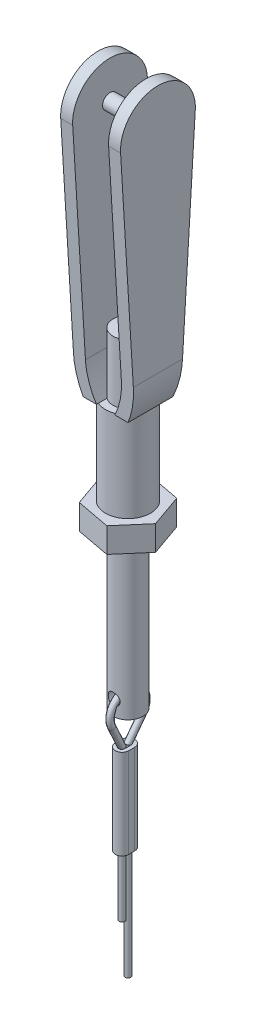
from build123d import *

# Parameters (mm, degrees)
EXTRUSION1_DEPTH             = 3
ENL_V_MAT_EXTRU_1_DEPTH      = 21.976176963
ENL_V_MAT_EXTRU_2_DEPTH      = 21.615528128
ESQUISSE4_R                  = 0.5
EXTRUSION2_DEPTH             = 2.4
ESQUISSE5_R                  = 1.5
EXTRUSION3_DEPTH             = 6
ESQUISSE6_R                  = 1
ENL_V_MAT_EXTRU_3_DEPTH      = 10
BOSS_EXTRU_1_DEPTH           = 12
BOSS_EXTRU_1_DEPTH_BACK      = 10
ESQUISSE8_R                  = 1
ENL_V_MAT_EXTRU_4_DEPTH      = 20.267848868
ENL_V_MAT_EXTRU_4_DEPTH_BACK = 20.267848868
ESQUISSE9_R                  = 0.4
ESQUISSE11_R                 = 0.2
BOSS_EXTRU_2_DEPTH           = 6
ESQUISSE14_R                 = 1
BOSS_EXTRU_4_DEPTH           = 1.66


with BuildPart() as part:
    # Esquisse1 → Extrusion1 (new, symmetric)
    with BuildSketch(Plane.XY):
        with BuildLine():
            Line((-2, 2.355843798), (-2, 20))
            Line((-2, 20), (2, 20))
            Line((2, 20), (2, 2.355843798))
            ThreePointArc((2, 2.355843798), (1.873623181, 1.15168434), (1.5, 0))
            Line((1.5, 0), (-1.5, 0))
            ThreePointArc((-1.5, 0), (-1.873623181, 1.15168434), (-2, 2.355843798))
        make_face()
    extrude(amount=EXTRUSION1_DEPTH, both=True)

    # Esquisse2 → Enl_v. mat.-Extru.1 (cut, through all)
    with BuildSketch(Plane.XY.offset(3)):
        with BuildLine():
            Line((-1.2, 20), (-1.2, 2.355843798))
            ThreePointArc((-1.2, 2.355843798), (-1.050313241, 1.14156975), (-0.610215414, 0))
            Line((-0.610215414, 0), (0.610215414, 0))
            ThreePointArc((0.610215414, 0), (1.050313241, 1.14156975), (1.2, 2.355843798))
            Line((1.2, 2.355843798), (1.2, 20))
            Line((1.2, 20), (-1.2, 20))
        make_face()
    extrude(amount=-ENL_V_MAT_EXTRU_1_DEPTH, mode=Mode.SUBTRACT)


with BuildPart() as enl_v_mat_extru_1_piece_1:
    # of the separate pieces the step leaves, piece 1, a body of its own (enl_v_mat_extru_1_pieces)
    add(part.part.solids().sort_by_distance((1.5, 0, -3))[0])


with BuildPart() as enl_v_mat_extru_1_piece_2:
    # of the separate pieces the step leaves, piece 2, a body of its own (enl_v_mat_extru_1_pieces)
    add(part.part.solids().sort_by_distance((-1.5, 0, -3))[0])


with BuildPart() as enl_v_mat_extru_2_tool:
    # Esquisse3 → Enl_v. mat.-Extru.2 (new, through all)
    with BuildSketch(Plane(origin=(2, 0, 0), x_dir=(0, 0, -1), z_dir=(1, 0, 0))):
        with BuildLine():
            Line((-1.5, 0), (-2.495378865, 16.348064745))
            ThreePointArc((-2.495378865, 16.348064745), (0, 19), (2.495378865, 16.348064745))
            Line((2.495378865, 16.348064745), (1.5, 0))
            Line((1.5, 0), (3, 0))
            Line((3, 0), (3, 20))
            Line((3, 20), (-3, 20))
            Line((-3, 20), (-3, 0))
            Line((-3, 0), (-1.5, 0))
        make_face()
    extrude(amount=-ENL_V_MAT_EXTRU_2_DEPTH)


with BuildPart() as enl_v_mat_extru_1_piece_1_1:
    add(enl_v_mat_extru_1_piece_1.part)

    # Enl_v. mat.-Extru.2: cut by enl_v_mat_extru_2_tool
    add(enl_v_mat_extru_2_tool.part, mode=Mode.SUBTRACT)



with BuildPart() as enl_v_mat_extru_1_piece_2_1:
    add(enl_v_mat_extru_1_piece_2.part)

    # Enl_v. mat.-Extru.2: cut by enl_v_mat_extru_2_tool
    add(enl_v_mat_extru_2_tool.part, mode=Mode.SUBTRACT)


with BuildPart() as enl_v_mat_extru_1_piece_1_2:
    add(enl_v_mat_extru_1_piece_1_1.part)

    add(enl_v_mat_extru_1_piece_2_1.part)  # Extrusion2 merges Enl_v. mat.-Extru.1 piece 2
    # Esquisse4 → Extrusion2 (add)
    with BuildSketch(Plane(origin=(-1.2, 0, 0), x_dir=(0, 0, -1), z_dir=(1, 0, 0))):
        with Locations(Location((0, 16.5, 0), (0, 0, 180))):
            Circle(ESQUISSE4_R)
    extrude(amount=EXTRUSION2_DEPTH)

    # Esquisse5 → Extrusion3 (add)
    with BuildSketch(Plane.XZ):
        with Locations(Location((0, 0, 0), (0, 0, 65.995381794))):
            Circle(ESQUISSE5_R)
    extrude(amount=EXTRUSION3_DEPTH)

    # Esquisse6 → Enl_v. mat.-Extru.3 (cut)
    with BuildSketch(Plane.XZ.offset(6)):
        with Locations(Location((0, 0, 0), (0, 0, 270))):
            Circle(ESQUISSE6_R)
    extrude(amount=-ENL_V_MAT_EXTRU_3_DEPTH, mode=Mode.SUBTRACT)


with BuildPart() as body_2:
    # Esquisse8 → Boss.-Extru.1 (new, two sides: drawn at the far end of the back side and taken through both)
    with BuildSketch(Plane.XZ.offset(6).offset(-BOSS_EXTRU_1_DEPTH_BACK)):
        with Locations(Location((0, 0, 0), (0, 0, 270))):
            Circle(ESQUISSE8_R)
    extrude(amount=BOSS_EXTRU_1_DEPTH + BOSS_EXTRU_1_DEPTH_BACK)

    # Esquisse9 → Enl_v. mat.-Extru.4 (cut, two sides: drawn at the far end of the back side and taken through both)
    with BuildSketch(Plane.XY.offset(-ENL_V_MAT_EXTRU_4_DEPTH_BACK)):
        with Locations((0, -17)):
            Circle(ESQUISSE9_R)
    extrude(amount=ENL_V_MAT_EXTRU_4_DEPTH + ENL_V_MAT_EXTRU_4_DEPTH_BACK, mode=Mode.SUBTRACT)


with BuildPart() as body_3:
    # Balayage1: sweep along a path in Esquisse10
    with BuildLine(Plane(origin=(0, 0, 0), x_dir=(0, 0, -1), z_dir=(1, 0, 0))) as balayage1_path:
        Line((0, -33.5), (0, -20.063324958))
        Line((0, -20.063324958), (0.96, -18.783324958))
        ThreePointArc((0.96, -18.783324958), (0.126891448, -16.870052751), (-1.089947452, -18.565335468))
        Line((-1.089947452, -18.565335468), (-0.4, -20.063324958))
        Line((-0.4, -20.063324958), (-0.4, -30.063324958))
    # Esquisse11 → Balayage1 (sweep)
    with BuildSketch(Plane(origin=(0, -30.063324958, 0.4), x_dir=(1, 0, 0), z_dir=(0, -1, 0))):
        Circle(ESQUISSE11_R)
    sweep(path=balayage1_path.line, transition=Transition.RIGHT)


with BuildPart() as body_4:
    # Esquisse12 → Boss.-Extru.2 (new body)
    with BuildSketch(Plane.XZ.offset(20.063324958)):
        with BuildLine():
            Line((0.45, 0.4), (0.45, 0))
            ThreePointArc((0.45, 0), (0, -0.45), (-0.45, 0))
            Line((-0.45, 0), (-0.45, 0.4))
            ThreePointArc((-0.45, 0.4), (0, 0.85), (0.45, 0.4))
        make_face()
        with BuildLine():
            Line((0.2, 0.4), (0.2, 0))
            ThreePointArc((0.2, 0), (0, -0.2), (-0.2, 0))
            Line((-0.2, 0), (-0.2, 0.4))
            ThreePointArc((-0.2, 0.4), (0, 0.6), (0.2, 0.4))
        make_face(mode=Mode.SUBTRACT)
    extrude(amount=BOSS_EXTRU_2_DEPTH)


with BuildPart() as body_5:
    # Esquisse14 → Boss.-Extru.4 (new body)
    with BuildSketch(Plane.XZ.offset(6)):
        Polygon((1.505302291, -1.751398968), (2.269407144, 0.427930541), (0.764104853, 2.179329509), (-1.505302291, 1.751398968), (-2.269407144, -0.427930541), (-0.764104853, -2.179329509), align=None)
        with Locations(Location((0, 0, 0), (0, 0, 90))):
            Circle(ESQUISSE14_R, mode=Mode.SUBTRACT)
    extrude(amount=BOSS_EXTRU_4_DEPTH)


solid = Compound([enl_v_mat_extru_1_piece_1_2.part, body_2.part, body_3.part, body_4.part, body_5.part])
